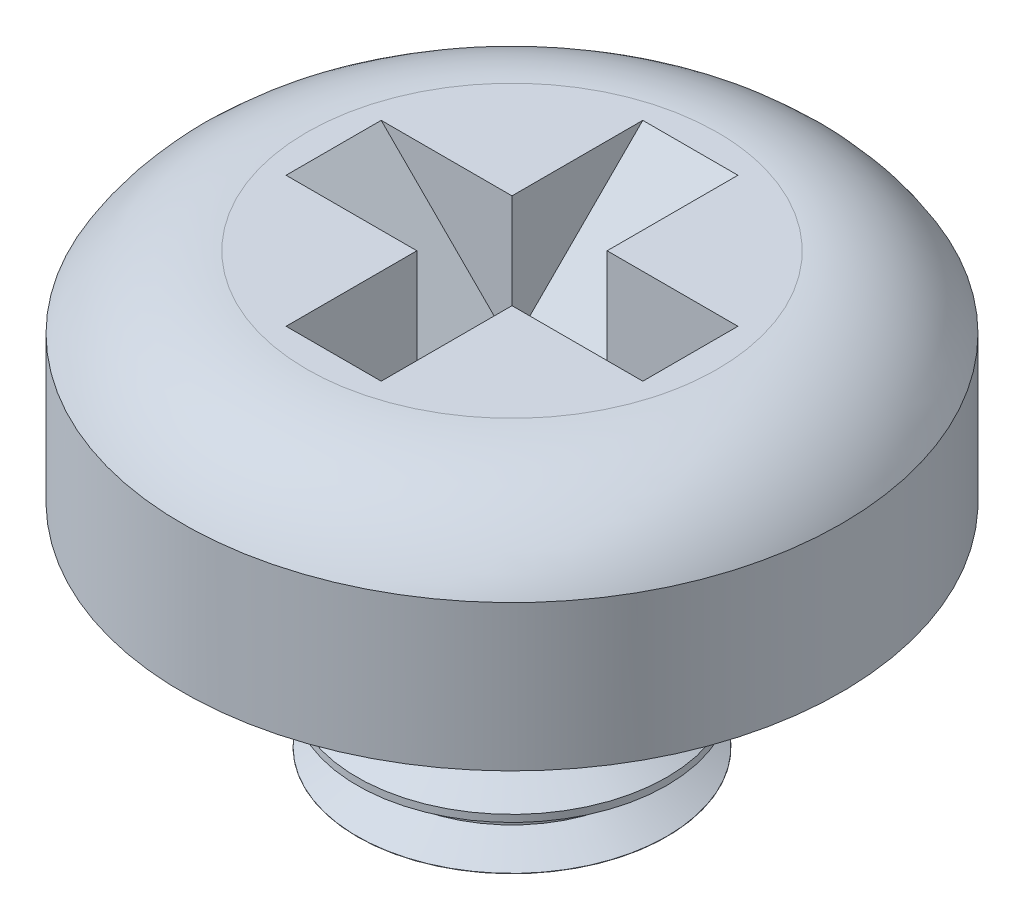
ISO-10303-21;
HEADER;
FILE_DESCRIPTION(('STEP AP214'),'2;1');
FILE_NAME('part.step','',(''),(''),'','','');
FILE_SCHEMA(('AUTOMOTIVE_DESIGN { 1 0 10303 214 1 1 1 1 }'));
ENDSEC;
DATA;
#1=APPLICATION_CONTEXT('core data for automotive mechanical design processes');
#2=APPLICATION_PROTOCOL_DEFINITION('international standard','automotive_design',2000,#1);
#3=PRODUCT_CONTEXT('',#1,'mechanical');
#4=PRODUCT('Part','Part','',(#3));
#5=PRODUCT_RELATED_PRODUCT_CATEGORY('part','',(#4));
#6=PRODUCT_DEFINITION_FORMATION('','',#4);
#7=PRODUCT_DEFINITION_CONTEXT('part definition',#1,'design');
#8=PRODUCT_DEFINITION('design','',#6,#7);
#9=PRODUCT_DEFINITION_SHAPE('','',#8);
#10=(LENGTH_UNIT() NAMED_UNIT(*) SI_UNIT(.MILLI.,.METRE.));
#11=(NAMED_UNIT(*) PLANE_ANGLE_UNIT() SI_UNIT($,.RADIAN.));
#12=(NAMED_UNIT(*) SI_UNIT($,.STERADIAN.) SOLID_ANGLE_UNIT());
#13=UNCERTAINTY_MEASURE_WITH_UNIT(LENGTH_MEASURE(1.E-05),#10,'distance_accuracy_value','');
#14=(GEOMETRIC_REPRESENTATION_CONTEXT(3) GLOBAL_UNCERTAINTY_ASSIGNED_CONTEXT((#13)) GLOBAL_UNIT_ASSIGNED_CONTEXT((#10,
#11,#12)) REPRESENTATION_CONTEXT('',''));
#15=CARTESIAN_POINT('',(0.,0.,0.));
#16=DIRECTION('',(0.,0.,1.));
#17=DIRECTION('',(1.,0.,0.));
#18=AXIS2_PLACEMENT_3D('',#15,#16,#17);
#19=CARTESIAN_POINT('',(0.695421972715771,142.281830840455,0.));
#20=DIRECTION('',(0.,-1.,0.));
#21=DIRECTION('',(0.,0.,-1.));
#22=AXIS2_PLACEMENT_3D('',#19,#20,#21);
#23=CYLINDRICAL_SURFACE('',#22,2.404411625);
#24=CARTESIAN_POINT('',(0.695421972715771,142.281830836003,0.));
#25=DIRECTION('',(0.,-1.,0.));
#26=DIRECTION('',(1.,0.,0.));
#27=AXIS2_PLACEMENT_3D('',#24,#25,#26);
#28=CIRCLE('',#27,2.40441162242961);
#29=CARTESIAN_POINT('',(3.09983359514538,142.281830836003,0.));
#30=VERTEX_POINT('',#29);
#31=EDGE_CURVE('E371',#30,#30,#28,.F.);
#32=ORIENTED_EDGE('',*,*,#31,.F.);
#33=EDGE_LOOP('',(#32));
#34=FACE_BOUND('',#33,.T.);
#35=CARTESIAN_POINT('',(0.695421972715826,142.276872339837,0.));
#36=DIRECTION('',(0.,-1.,0.));
#37=DIRECTION('',(0.,0.,-1.));
#38=AXIS2_PLACEMENT_3D('',#35,#36,#37);
#39=CIRCLE('',#38,2.404411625);
#40=CARTESIAN_POINT('',(0.695421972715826,142.276872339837,-2.40441162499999));
#41=VERTEX_POINT('',#40);
#42=EDGE_CURVE('E45',#41,#41,#39,.F.);
#43=ORIENTED_EDGE('',*,*,#42,.T.);
#44=EDGE_LOOP('',(#43));
#45=FACE_BOUND('',#44,.T.);
#46=ADVANCED_FACE('F40',(#34,#45),#23,.T.);
#47=CARTESIAN_POINT('',(0.695421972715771,142.574565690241,0.));
#48=DIRECTION('',(0.,-1.,0.));
#49=DIRECTION('',(0.,0.,-1.));
#50=AXIS2_PLACEMENT_3D('',#47,#48,#49);
#51=CONICAL_SURFACE('',#50,1.89738000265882,1.04719753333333);
#52=ORIENTED_EDGE('',*,*,#31,.T.);
#53=EDGE_LOOP('',(#52));
#54=FACE_BOUND('',#53,.T.);
#55=CARTESIAN_POINT('',(0.695421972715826,142.574565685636,0.));
#56=DIRECTION('',(0.,-1.,0.));
#57=DIRECTION('',(1.,0.,0.));
#58=AXIS2_PLACEMENT_3D('',#55,#56,#57);
#59=CIRCLE('',#58,1.89738);
#60=CARTESIAN_POINT('',(2.59280197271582,142.574565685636,0.));
#61=VERTEX_POINT('',#60);
#62=EDGE_CURVE('E368',#61,#61,#59,.F.);
#63=ORIENTED_EDGE('',*,*,#62,.F.);
#64=EDGE_LOOP('',(#63));
#65=FACE_BOUND('',#64,.T.);
#66=ADVANCED_FACE('F415',(#54,#65),#51,.T.);
#67=CARTESIAN_POINT('',(0.695421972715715,142.673710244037,0.));
#68=DIRECTION('',(0.,-1.,0.));
#69=DIRECTION('',(0.,0.,-1.));
#70=AXIS2_PLACEMENT_3D('',#67,#68,#69);
#71=CYLINDRICAL_SURFACE('',#70,1.89738);
#72=ORIENTED_EDGE('',*,*,#62,.T.);
#73=EDGE_LOOP('',(#72));
#74=FACE_BOUND('',#73,.T.);
#75=CARTESIAN_POINT('',(0.695421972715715,142.673710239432,0.));
#76=DIRECTION('',(0.,1.,0.));
#77=DIRECTION('',(1.,0.,0.));
#78=AXIS2_PLACEMENT_3D('',#75,#76,#77);
#79=CIRCLE('',#78,1.89738000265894);
#80=CARTESIAN_POINT('',(2.59280197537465,142.673710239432,0.));
#81=VERTEX_POINT('',#80);
#82=EDGE_CURVE('E365',#81,#81,#79,.T.);
#83=ORIENTED_EDGE('',*,*,#82,.F.);
#84=EDGE_LOOP('',(#83));
#85=FACE_BOUND('',#84,.T.);
#86=ADVANCED_FACE('F421',(#74,#85),#71,.T.);
#87=CARTESIAN_POINT('',(0.695421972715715,142.673710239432,0.));
#88=DIRECTION('',(0.,1.,0.));
#89=DIRECTION('',(0.,0.,1.));
#90=AXIS2_PLACEMENT_3D('',#87,#88,#89);
#91=CONICAL_SURFACE('',#90,1.89738000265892,1.04719753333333);
#92=ORIENTED_EDGE('',*,*,#82,.T.);
#93=EDGE_LOOP('',(#92));
#94=FACE_BOUND('',#93,.T.);
#95=CARTESIAN_POINT('',(0.695421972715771,142.966445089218,0.));
#96=DIRECTION('',(0.,-1.,0.));
#97=DIRECTION('',(1.,0.,0.));
#98=AXIS2_PLACEMENT_3D('',#95,#96,#97);
#99=CIRCLE('',#98,2.404411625);
#100=CARTESIAN_POINT('',(3.09983359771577,142.966445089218,0.));
#101=VERTEX_POINT('',#100);
#102=EDGE_CURVE('E362',#101,#101,#99,.F.);
#103=ORIENTED_EDGE('',*,*,#102,.F.);
#104=EDGE_LOOP('',(#103));
#105=FACE_BOUND('',#104,.T.);
#106=ADVANCED_FACE('F430',(#94,#105),#91,.T.);
#107=CARTESIAN_POINT('',(0.695421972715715,143.075580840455,0.));
#108=DIRECTION('',(0.,-1.,0.));
#109=DIRECTION('',(0.,0.,-1.));
#110=AXIS2_PLACEMENT_3D('',#107,#108,#109);
#111=CYLINDRICAL_SURFACE('',#110,2.404411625);
#112=ORIENTED_EDGE('',*,*,#102,.T.);
#113=EDGE_LOOP('',(#112));
#114=FACE_BOUND('',#113,.T.);
#115=CARTESIAN_POINT('',(0.695421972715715,143.075580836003,0.));
#116=DIRECTION('',(0.,-1.,0.));
#117=DIRECTION('',(1.,0.,0.));
#118=AXIS2_PLACEMENT_3D('',#115,#116,#117);
#119=CIRCLE('',#118,2.40441162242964);
#120=CARTESIAN_POINT('',(3.09983359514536,143.075580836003,0.));
#121=VERTEX_POINT('',#120);
#122=EDGE_CURVE('E359',#121,#121,#119,.F.);
#123=ORIENTED_EDGE('',*,*,#122,.F.);
#124=EDGE_LOOP('',(#123));
#125=FACE_BOUND('',#124,.T.);
#126=ADVANCED_FACE('F434',(#114,#125),#111,.T.);
#127=CARTESIAN_POINT('',(0.695421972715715,143.368315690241,0.));
#128=DIRECTION('',(0.,-1.,0.));
#129=DIRECTION('',(0.,0.,-1.));
#130=AXIS2_PLACEMENT_3D('',#127,#128,#129);
#131=CONICAL_SURFACE('',#130,1.89738000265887,1.04719753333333);
#132=ORIENTED_EDGE('',*,*,#122,.T.);
#133=EDGE_LOOP('',(#132));
#134=FACE_BOUND('',#133,.T.);
#135=CARTESIAN_POINT('',(0.695421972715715,143.368315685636,0.));
#136=DIRECTION('',(0.,-1.,0.));
#137=DIRECTION('',(1.,0.,0.));
#138=AXIS2_PLACEMENT_3D('',#135,#136,#137);
#139=CIRCLE('',#138,1.89738);
#140=CARTESIAN_POINT('',(2.59280197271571,143.368315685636,0.));
#141=VERTEX_POINT('',#140);
#142=EDGE_CURVE('E356',#141,#141,#139,.F.);
#143=ORIENTED_EDGE('',*,*,#142,.F.);
#144=EDGE_LOOP('',(#143));
#145=FACE_BOUND('',#144,.T.);
#146=ADVANCED_FACE('F438',(#134,#145),#131,.T.);
#147=CARTESIAN_POINT('',(0.695421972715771,143.467460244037,0.));
#148=DIRECTION('',(0.,-1.,0.));
#149=DIRECTION('',(0.,0.,-1.));
#150=AXIS2_PLACEMENT_3D('',#147,#148,#149);
#151=CYLINDRICAL_SURFACE('',#150,1.89738);
#152=ORIENTED_EDGE('',*,*,#142,.T.);
#153=EDGE_LOOP('',(#152));
#154=FACE_BOUND('',#153,.T.);
#155=CARTESIAN_POINT('',(0.695421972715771,143.467460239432,0.));
#156=DIRECTION('',(0.,1.,0.));
#157=DIRECTION('',(1.,0.,0.));
#158=AXIS2_PLACEMENT_3D('',#155,#156,#157);
#159=CIRCLE('',#158,1.89738000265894);
#160=CARTESIAN_POINT('',(2.59280197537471,143.467460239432,0.));
#161=VERTEX_POINT('',#160);
#162=EDGE_CURVE('E158',#161,#161,#159,.T.);
#163=ORIENTED_EDGE('',*,*,#162,.F.);
#164=EDGE_LOOP('',(#163));
#165=FACE_BOUND('',#164,.T.);
#166=ADVANCED_FACE('F442',(#154,#165),#151,.T.);
#167=CARTESIAN_POINT('',(0.695421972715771,143.467460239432,0.));
#168=DIRECTION('',(0.,1.,0.));
#169=DIRECTION('',(0.,0.,1.));
#170=AXIS2_PLACEMENT_3D('',#167,#168,#169);
#171=CONICAL_SURFACE('',#170,1.89738000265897,1.04719753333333);
#172=ORIENTED_EDGE('',*,*,#162,.T.);
#173=EDGE_LOOP('',(#172));
#174=FACE_BOUND('',#173,.T.);
#175=CARTESIAN_POINT('',(0.695421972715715,143.760195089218,0.));
#176=DIRECTION('',(0.,-1.,0.));
#177=DIRECTION('',(1.,0.,0.));
#178=AXIS2_PLACEMENT_3D('',#175,#176,#177);
#179=CIRCLE('',#178,2.404411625);
#180=CARTESIAN_POINT('',(3.09983359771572,143.760195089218,0.));
#181=VERTEX_POINT('',#180);
#182=EDGE_CURVE('E202',#181,#181,#179,.F.);
#183=ORIENTED_EDGE('',*,*,#182,.F.);
#184=EDGE_LOOP('',(#183));
#185=FACE_BOUND('',#184,.T.);
#186=ADVANCED_FACE('F446',(#174,#185),#171,.T.);
#187=CARTESIAN_POINT('',(0.695421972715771,146.186884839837,0.));
#188=DIRECTION('',(0.707106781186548,0.707106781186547,0.));
#189=DIRECTION('',(-0.707106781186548,0.707106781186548,0.));
#190=AXIS2_PLACEMENT_3D('',#187,#188,#189);
#191=PLANE('',#190);
#192=DIRECTION('',(0.,0.,1.));
#193=VECTOR('',#192,1.);
#194=CARTESIAN_POINT('',(0.695421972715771,146.186884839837,0.));
#195=LINE('',#194,#193);
#196=CARTESIAN_POINT('',(0.695421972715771,146.186884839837,-0.738716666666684));
#197=VERTEX_POINT('',#196);
#198=CARTESIAN_POINT('',(0.695421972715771,146.186884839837,0.));
#199=VERTEX_POINT('',#198);
#200=EDGE_CURVE('E151',#197,#199,#195,.T.);
#201=ORIENTED_EDGE('',*,*,#200,.F.);
#202=DIRECTION('',(0.707106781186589,-0.707106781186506,0.));
#203=VECTOR('',#202,1.);
#204=CARTESIAN_POINT('',(-0.0432946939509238,146.925601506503,-0.738716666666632));
#205=LINE('',#204,#203);
#206=CARTESIAN_POINT('',(-0.0432946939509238,146.925601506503,-0.738716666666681));
#207=VERTEX_POINT('',#206);
#208=EDGE_CURVE('E120',#207,#197,#205,.T.);
#209=ORIENTED_EDGE('',*,*,#208,.F.);
#210=DIRECTION('',(-0.577350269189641,0.577350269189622,-0.577350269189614));
#211=VECTOR('',#210,1.);
#212=CARTESIAN_POINT('',(0.695421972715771,146.186884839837,0.));
#213=LINE('',#212,#211);
#214=EDGE_CURVE('E186',#199,#207,#213,.T.);
#215=ORIENTED_EDGE('',*,*,#214,.F.);
#216=EDGE_LOOP('',(#201,#209,#215));
#217=FACE_BOUND('',#216,.T.);
#218=ADVANCED_FACE('F187',(#217),#191,.T.);
#219=CARTESIAN_POINT('',(3.46560947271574,148.957072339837,0.));
#220=DIRECTION('',(-0.707106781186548,0.707106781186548,0.));
#221=DIRECTION('',(-0.707106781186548,-0.707106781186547,0.));
#222=AXIS2_PLACEMENT_3D('',#219,#220,#221);
#223=PLANE('',#222);
#224=DIRECTION('',(0.707106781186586,0.707106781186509,0.));
#225=VECTOR('',#224,1.);
#226=CARTESIAN_POINT('',(0.695421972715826,146.186884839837,-0.738716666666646));
#227=LINE('',#226,#225);
#228=CARTESIAN_POINT('',(1.43413863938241,146.925601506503,-0.738716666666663));
#229=VERTEX_POINT('',#228);
#230=EDGE_CURVE('E157',#197,#229,#227,.T.);
#231=ORIENTED_EDGE('',*,*,#230,.F.);
#232=ORIENTED_EDGE('',*,*,#200,.T.);
#233=DIRECTION('',(-0.577350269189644,-0.577350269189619,0.577350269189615));
#234=VECTOR('',#233,1.);
#235=CARTESIAN_POINT('',(1.43413863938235,146.925601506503,-0.738716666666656));
#236=LINE('',#235,#234);
#237=EDGE_CURVE('E154',#229,#199,#236,.T.);
#238=ORIENTED_EDGE('',*,*,#237,.F.);
#239=EDGE_LOOP('',(#231,#232,#238));
#240=FACE_BOUND('',#239,.T.);
#241=ADVANCED_FACE('F153',(#240),#223,.T.);
#242=CARTESIAN_POINT('',(0.695421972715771,148.957072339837,-2.77018750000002));
#243=DIRECTION('',(0.,0.707106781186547,0.707106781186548));
#244=DIRECTION('',(0.,-0.707106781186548,0.707106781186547));
#245=AXIS2_PLACEMENT_3D('',#242,#243,#244);
#246=PLANE('',#245);
#247=DIRECTION('',(1.,0.,0.));
#248=VECTOR('',#247,1.);
#249=CARTESIAN_POINT('',(0.695421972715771,146.186884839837,0.));
#250=LINE('',#249,#248);
#251=CARTESIAN_POINT('',(1.43413863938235,146.186884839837,0.));
#252=VERTEX_POINT('',#251);
#253=EDGE_CURVE('E163',#252,#199,#250,.F.);
#254=ORIENTED_EDGE('',*,*,#253,.F.);
#255=DIRECTION('',(0.,-0.707106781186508,0.707106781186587));
#256=VECTOR('',#255,1.);
#257=CARTESIAN_POINT('',(1.43413863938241,146.925601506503,-0.738716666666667));
#258=LINE('',#257,#256);
#259=EDGE_CURVE('E166',#229,#252,#258,.T.);
#260=ORIENTED_EDGE('',*,*,#259,.F.);
#261=ORIENTED_EDGE('',*,*,#237,.T.);
#262=EDGE_LOOP('',(#254,#260,#261));
#263=FACE_BOUND('',#262,.T.);
#264=ADVANCED_FACE('F162',(#263),#246,.T.);
#265=CARTESIAN_POINT('',(0.695421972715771,146.186884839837,0.));
#266=DIRECTION('',(0.,0.707106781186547,-0.707106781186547));
#267=DIRECTION('',(0.,0.707106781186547,0.707106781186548));
#268=AXIS2_PLACEMENT_3D('',#265,#266,#267);
#269=PLANE('',#268);
#270=DIRECTION('',(0.,0.707106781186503,0.707106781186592));
#271=VECTOR('',#270,1.);
#272=CARTESIAN_POINT('',(1.43413863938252,146.186884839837,0.));
#273=LINE('',#272,#271);
#274=CARTESIAN_POINT('',(1.43413863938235,146.925601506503,0.738716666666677));
#275=VERTEX_POINT('',#274);
#276=EDGE_CURVE('E174',#252,#275,#273,.T.);
#277=ORIENTED_EDGE('',*,*,#276,.F.);
#278=ORIENTED_EDGE('',*,*,#253,.T.);
#279=DIRECTION('',(-0.577350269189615,-0.577350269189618,-0.577350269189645));
#280=VECTOR('',#279,1.);
#281=CARTESIAN_POINT('',(1.43413863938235,146.925601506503,0.738716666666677));
#282=LINE('',#281,#280);
#283=EDGE_CURVE('E171',#275,#199,#282,.T.);
#284=ORIENTED_EDGE('',*,*,#283,.F.);
#285=EDGE_LOOP('',(#277,#278,#284));
#286=FACE_BOUND('',#285,.T.);
#287=ADVANCED_FACE('F170',(#286),#269,.T.);
#288=CARTESIAN_POINT('',(3.46560947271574,148.957072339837,0.));
#289=DIRECTION('',(-0.707106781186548,0.707106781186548,0.));
#290=DIRECTION('',(-0.707106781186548,-0.707106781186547,0.));
#291=AXIS2_PLACEMENT_3D('',#288,#289,#290);
#292=PLANE('',#291);
#293=DIRECTION('',(0.,0.,1.));
#294=VECTOR('',#293,1.);
#295=CARTESIAN_POINT('',(0.695421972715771,146.186884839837,0.));
#296=LINE('',#295,#294);
#297=CARTESIAN_POINT('',(0.695421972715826,146.186884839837,0.73871666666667));
#298=VERTEX_POINT('',#297);
#299=EDGE_CURVE('E178',#298,#199,#296,.F.);
#300=ORIENTED_EDGE('',*,*,#299,.F.);
#301=DIRECTION('',(-0.707106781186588,-0.707106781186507,0.));
#302=VECTOR('',#301,1.);
#303=CARTESIAN_POINT('',(1.43413863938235,146.925601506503,0.738716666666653));
#304=LINE('',#303,#302);
#305=EDGE_CURVE('E180',#275,#298,#304,.T.);
#306=ORIENTED_EDGE('',*,*,#305,.F.);
#307=ORIENTED_EDGE('',*,*,#283,.T.);
#308=EDGE_LOOP('',(#300,#306,#307));
#309=FACE_BOUND('',#308,.T.);
#310=ADVANCED_FACE('F177',(#309),#292,.T.);
#311=CARTESIAN_POINT('',(0.695421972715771,146.186884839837,0.));
#312=DIRECTION('',(0.707106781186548,0.707106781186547,0.));
#313=DIRECTION('',(-0.707106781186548,0.707106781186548,0.));
#314=AXIS2_PLACEMENT_3D('',#311,#312,#313);
#315=PLANE('',#314);
#316=DIRECTION('',(-0.707106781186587,0.707106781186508,0.));
#317=VECTOR('',#316,1.);
#318=CARTESIAN_POINT('',(0.695421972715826,146.186884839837,0.738716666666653));
#319=LINE('',#318,#317);
#320=CARTESIAN_POINT('',(-0.0432946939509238,146.925601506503,0.738716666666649));
#321=VERTEX_POINT('',#320);
#322=EDGE_CURVE('E184',#298,#321,#319,.T.);
#323=ORIENTED_EDGE('',*,*,#322,.F.);
#324=ORIENTED_EDGE('',*,*,#299,.T.);
#325=DIRECTION('',(0.577350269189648,-0.577350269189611,-0.577350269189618));
#326=VECTOR('',#325,1.);
#327=CARTESIAN_POINT('',(-0.0432946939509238,146.925601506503,0.738716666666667));
#328=LINE('',#327,#326);
#329=EDGE_CURVE('E128',#321,#199,#328,.T.);
#330=ORIENTED_EDGE('',*,*,#329,.F.);
#331=EDGE_LOOP('',(#323,#324,#330));
#332=FACE_BOUND('',#331,.T.);
#333=ADVANCED_FACE('F182',(#332),#315,.T.);
#334=CARTESIAN_POINT('',(0.695421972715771,146.186884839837,0.));
#335=DIRECTION('',(0.,0.707106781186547,-0.707106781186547));
#336=DIRECTION('',(0.,0.707106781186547,0.707106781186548));
#337=AXIS2_PLACEMENT_3D('',#334,#335,#336);
#338=PLANE('',#337);
#339=DIRECTION('',(1.,0.,0.));
#340=VECTOR('',#339,1.);
#341=CARTESIAN_POINT('',(0.695421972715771,146.186884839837,0.));
#342=LINE('',#341,#340);
#343=CARTESIAN_POINT('',(-0.0432946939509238,146.186884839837,0.));
#344=VERTEX_POINT('',#343);
#345=EDGE_CURVE('E192',#344,#199,#342,.T.);
#346=ORIENTED_EDGE('',*,*,#345,.F.);
#347=DIRECTION('',(0.,-0.707106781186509,-0.707106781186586));
#348=VECTOR('',#347,1.);
#349=CARTESIAN_POINT('',(-0.0432946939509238,146.925601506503,0.738716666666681));
#350=LINE('',#349,#348);
#351=EDGE_CURVE('E197',#321,#344,#350,.T.);
#352=ORIENTED_EDGE('',*,*,#351,.F.);
#353=ORIENTED_EDGE('',*,*,#329,.T.);
#354=EDGE_LOOP('',(#346,#352,#353));
#355=FACE_BOUND('',#354,.T.);
#356=ADVANCED_FACE('F195',(#355),#338,.T.);
#357=CARTESIAN_POINT('',(0.695421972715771,148.957072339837,-2.77018750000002));
#358=DIRECTION('',(0.,0.707106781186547,0.707106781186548));
#359=DIRECTION('',(0.,-0.707106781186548,0.707106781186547));
#360=AXIS2_PLACEMENT_3D('',#357,#358,#359);
#361=PLANE('',#360);
#362=DIRECTION('',(0.,0.707106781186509,-0.707106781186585));
#363=VECTOR('',#362,1.);
#364=CARTESIAN_POINT('',(-0.0432946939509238,146.186884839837,0.));
#365=LINE('',#364,#363);
#366=EDGE_CURVE('E201',#344,#207,#365,.T.);
#367=ORIENTED_EDGE('',*,*,#366,.F.);
#368=ORIENTED_EDGE('',*,*,#345,.T.);
#369=ORIENTED_EDGE('',*,*,#214,.T.);
#370=EDGE_LOOP('',(#367,#368,#369));
#371=FACE_BOUND('',#370,.T.);
#372=ADVANCED_FACE('F199',(#371),#361,.T.);
#373=CARTESIAN_POINT('',(0.695421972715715,143.869330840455,0.));
#374=DIRECTION('',(0.,-1.,0.));
#375=DIRECTION('',(0.,0.,-1.));
#376=AXIS2_PLACEMENT_3D('',#373,#374,#375);
#377=CYLINDRICAL_SURFACE('',#376,2.404411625);
#378=ORIENTED_EDGE('',*,*,#182,.T.);
#379=EDGE_LOOP('',(#378));
#380=FACE_BOUND('',#379,.T.);
#381=CARTESIAN_POINT('',(0.695421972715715,143.869330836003,0.));
#382=DIRECTION('',(0.,-1.,0.));
#383=DIRECTION('',(1.,0.,0.));
#384=AXIS2_PLACEMENT_3D('',#381,#382,#383);
#385=CIRCLE('',#384,2.40441162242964);
#386=CARTESIAN_POINT('',(3.09983359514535,143.869330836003,0.));
#387=VERTEX_POINT('',#386);
#388=EDGE_CURVE('E214',#387,#387,#385,.F.);
#389=ORIENTED_EDGE('',*,*,#388,.F.);
#390=EDGE_LOOP('',(#389));
#391=FACE_BOUND('',#390,.T.);
#392=ADVANCED_FACE('F467',(#380,#391),#377,.T.);
#393=CARTESIAN_POINT('',(0.695421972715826,146.186884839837,-0.738716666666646));
#394=DIRECTION('',(0.,0.,1.));
#395=DIRECTION('',(1.,0.,0.));
#396=AXIS2_PLACEMENT_3D('',#393,#394,#395);
#397=PLANE('',#396);
#398=ORIENTED_EDGE('',*,*,#208,.T.);
#399=ORIENTED_EDGE('',*,*,#230,.T.);
#400=DIRECTION('',(1.,0.,0.));
#401=VECTOR('',#400,1.);
#402=CARTESIAN_POINT('',(0.695421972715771,146.925601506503,-0.738716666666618));
#403=LINE('',#402,#401);
#404=EDGE_CURVE('E219',#207,#229,#403,.T.);
#405=ORIENTED_EDGE('',*,*,#404,.F.);
#406=EDGE_LOOP('',(#398,#399,#405));
#407=FACE_BOUND('',#406,.T.);
#408=ADVANCED_FACE('F470',(#407),#397,.T.);
#409=CARTESIAN_POINT('',(1.43413863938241,148.957072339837,2.77018750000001));
#410=DIRECTION('',(-1.,0.,0.));
#411=DIRECTION('',(0.,0.,1.));
#412=AXIS2_PLACEMENT_3D('',#409,#410,#411);
#413=PLANE('',#412);
#414=ORIENTED_EDGE('',*,*,#259,.T.);
#415=ORIENTED_EDGE('',*,*,#276,.T.);
#416=DIRECTION('',(0.,0.,1.));
#417=VECTOR('',#416,1.);
#418=CARTESIAN_POINT('',(1.43413863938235,146.925601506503,0.));
#419=LINE('',#418,#417);
#420=EDGE_CURVE('E218',#229,#275,#419,.T.);
#421=ORIENTED_EDGE('',*,*,#420,.F.);
#422=EDGE_LOOP('',(#414,#415,#421));
#423=FACE_BOUND('',#422,.T.);
#424=ADVANCED_FACE('F474',(#423),#413,.T.);
#425=CARTESIAN_POINT('',(-2.07476552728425,148.957072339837,0.738716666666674));
#426=DIRECTION('',(0.,0.,-1.));
#427=DIRECTION('',(-1.,0.,0.));
#428=AXIS2_PLACEMENT_3D('',#425,#426,#427);
#429=PLANE('',#428);
#430=ORIENTED_EDGE('',*,*,#305,.T.);
#431=ORIENTED_EDGE('',*,*,#322,.T.);
#432=DIRECTION('',(1.,0.,0.));
#433=VECTOR('',#432,1.);
#434=CARTESIAN_POINT('',(0.695421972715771,146.925601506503,0.738716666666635));
#435=LINE('',#434,#433);
#436=EDGE_CURVE('E224',#275,#321,#435,.F.);
#437=ORIENTED_EDGE('',*,*,#436,.F.);
#438=EDGE_LOOP('',(#430,#431,#437));
#439=FACE_BOUND('',#438,.T.);
#440=ADVANCED_FACE('F478',(#439),#429,.T.);
#441=CARTESIAN_POINT('',(-0.0432946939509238,146.186884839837,0.));
#442=DIRECTION('',(1.,0.,0.));
#443=DIRECTION('',(0.,0.,-1.));
#444=AXIS2_PLACEMENT_3D('',#441,#442,#443);
#445=PLANE('',#444);
#446=ORIENTED_EDGE('',*,*,#351,.T.);
#447=ORIENTED_EDGE('',*,*,#366,.T.);
#448=DIRECTION('',(0.,0.,1.));
#449=VECTOR('',#448,1.);
#450=CARTESIAN_POINT('',(-0.0432946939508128,146.925601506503,0.));
#451=LINE('',#450,#449);
#452=EDGE_CURVE('E229',#321,#207,#451,.F.);
#453=ORIENTED_EDGE('',*,*,#452,.F.);
#454=EDGE_LOOP('',(#446,#447,#453));
#455=FACE_BOUND('',#454,.T.);
#456=ADVANCED_FACE('F482',(#455),#445,.T.);
#457=CARTESIAN_POINT('',(0.695421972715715,144.162065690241,0.));
#458=DIRECTION('',(0.,-1.,0.));
#459=DIRECTION('',(0.,0.,-1.));
#460=AXIS2_PLACEMENT_3D('',#457,#458,#459);
#461=CONICAL_SURFACE('',#460,1.89738000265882,1.04719753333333);
#462=ORIENTED_EDGE('',*,*,#388,.T.);
#463=EDGE_LOOP('',(#462));
#464=FACE_BOUND('',#463,.T.);
#465=CARTESIAN_POINT('',(0.695421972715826,144.162065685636,0.));
#466=DIRECTION('',(0.,-1.,0.));
#467=DIRECTION('',(1.,0.,0.));
#468=AXIS2_PLACEMENT_3D('',#465,#466,#467);
#469=CIRCLE('',#468,1.89738);
#470=CARTESIAN_POINT('',(2.59280197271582,144.162065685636,0.));
#471=VERTEX_POINT('',#470);
#472=EDGE_CURVE('E233',#471,#471,#469,.F.);
#473=ORIENTED_EDGE('',*,*,#472,.F.);
#474=EDGE_LOOP('',(#473));
#475=FACE_BOUND('',#474,.T.);
#476=ADVANCED_FACE('F486',(#464,#475),#461,.T.);
#477=CARTESIAN_POINT('',(0.695421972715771,148.957072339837,-2.77018750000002));
#478=DIRECTION('',(0.,0.707106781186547,0.707106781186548));
#479=DIRECTION('',(0.,-0.707106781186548,0.707106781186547));
#480=AXIS2_PLACEMENT_3D('',#477,#478,#479);
#481=PLANE('',#480);
#482=DIRECTION('',(1.,0.,0.));
#483=VECTOR('',#482,1.);
#484=CARTESIAN_POINT('',(0.695421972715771,148.957072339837,-2.77018750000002));
#485=LINE('',#484,#483);
#486=CARTESIAN_POINT('',(1.43413863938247,148.957072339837,-2.77018749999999));
#487=VERTEX_POINT('',#486);
#488=CARTESIAN_POINT('',(-0.0432946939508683,148.957072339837,-2.77018749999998));
#489=VERTEX_POINT('',#488);
#490=EDGE_CURVE('E216',#487,#489,#485,.F.);
#491=ORIENTED_EDGE('',*,*,#490,.T.);
#492=DIRECTION('',(0.,0.707106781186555,-0.70710678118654));
#493=VECTOR('',#492,1.);
#494=CARTESIAN_POINT('',(-0.0432946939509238,146.925601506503,-0.738716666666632));
#495=LINE('',#494,#493);
#496=EDGE_CURVE('E236',#207,#489,#495,.T.);
#497=ORIENTED_EDGE('',*,*,#496,.F.);
#498=ORIENTED_EDGE('',*,*,#404,.T.);
#499=DIRECTION('',(0.,-0.707106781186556,0.707106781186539));
#500=VECTOR('',#499,1.);
#501=CARTESIAN_POINT('',(1.43413863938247,148.957072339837,-2.77018749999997));
#502=LINE('',#501,#500);
#503=EDGE_CURVE('E238',#487,#229,#502,.T.);
#504=ORIENTED_EDGE('',*,*,#503,.F.);
#505=EDGE_LOOP('',(#491,#497,#498,#504));
#506=FACE_BOUND('',#505,.T.);
#507=ADVANCED_FACE('F490',(#506),#481,.T.);
#508=CARTESIAN_POINT('',(3.46560947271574,148.957072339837,0.));
#509=DIRECTION('',(-0.707106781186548,0.707106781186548,0.));
#510=DIRECTION('',(-0.707106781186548,-0.707106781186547,0.));
#511=AXIS2_PLACEMENT_3D('',#508,#509,#510);
#512=PLANE('',#511);
#513=DIRECTION('',(0.,0.,1.));
#514=VECTOR('',#513,1.);
#515=CARTESIAN_POINT('',(3.46560947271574,148.957072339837,0.));
#516=LINE('',#515,#514);
#517=CARTESIAN_POINT('',(3.46560947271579,148.957072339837,0.738716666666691));
#518=VERTEX_POINT('',#517);
#519=CARTESIAN_POINT('',(3.46560947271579,148.957072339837,-0.738716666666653));
#520=VERTEX_POINT('',#519);
#521=EDGE_CURVE('E222',#518,#520,#516,.F.);
#522=ORIENTED_EDGE('',*,*,#521,.T.);
#523=DIRECTION('',(0.70710678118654,0.707106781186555,0.));
#524=VECTOR('',#523,1.);
#525=CARTESIAN_POINT('',(1.43413863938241,146.925601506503,-0.738716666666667));
#526=LINE('',#525,#524);
#527=EDGE_CURVE('E242',#229,#520,#526,.T.);
#528=ORIENTED_EDGE('',*,*,#527,.F.);
#529=ORIENTED_EDGE('',*,*,#420,.T.);
#530=DIRECTION('',(-0.707106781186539,-0.707106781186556,0.));
#531=VECTOR('',#530,1.);
#532=CARTESIAN_POINT('',(3.46560947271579,148.957072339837,0.738716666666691));
#533=LINE('',#532,#531);
#534=EDGE_CURVE('E245',#518,#275,#533,.T.);
#535=ORIENTED_EDGE('',*,*,#534,.F.);
#536=EDGE_LOOP('',(#522,#528,#529,#535));
#537=FACE_BOUND('',#536,.T.);
#538=ADVANCED_FACE('F494',(#537),#512,.T.);
#539=CARTESIAN_POINT('',(0.695421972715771,146.186884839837,0.));
#540=DIRECTION('',(0.,0.707106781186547,-0.707106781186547));
#541=DIRECTION('',(0.,0.707106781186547,0.707106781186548));
#542=AXIS2_PLACEMENT_3D('',#539,#540,#541);
#543=PLANE('',#542);
#544=DIRECTION('',(1.,0.,0.));
#545=VECTOR('',#544,1.);
#546=CARTESIAN_POINT('',(0.695421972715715,148.957072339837,2.77018750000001));
#547=LINE('',#546,#545);
#548=CARTESIAN_POINT('',(-0.0432946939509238,148.957072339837,2.7701875));
#549=VERTEX_POINT('',#548);
#550=CARTESIAN_POINT('',(1.43413863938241,148.957072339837,2.77018750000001));
#551=VERTEX_POINT('',#550);
#552=EDGE_CURVE('E227',#549,#551,#547,.T.);
#553=ORIENTED_EDGE('',*,*,#552,.T.);
#554=DIRECTION('',(0.,0.707106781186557,0.707106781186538));
#555=VECTOR('',#554,1.);
#556=CARTESIAN_POINT('',(1.43413863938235,146.925601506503,0.738716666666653));
#557=LINE('',#556,#555);
#558=EDGE_CURVE('E251',#275,#551,#557,.T.);
#559=ORIENTED_EDGE('',*,*,#558,.F.);
#560=ORIENTED_EDGE('',*,*,#436,.T.);
#561=DIRECTION('',(0.,-0.707106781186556,-0.707106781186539));
#562=VECTOR('',#561,1.);
#563=CARTESIAN_POINT('',(-0.0432946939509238,148.957072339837,2.7701875));
#564=LINE('',#563,#562);
#565=EDGE_CURVE('E254',#549,#321,#564,.T.);
#566=ORIENTED_EDGE('',*,*,#565,.F.);
#567=EDGE_LOOP('',(#553,#559,#560,#566));
#568=FACE_BOUND('',#567,.T.);
#569=ADVANCED_FACE('F498',(#568),#543,.T.);
#570=CARTESIAN_POINT('',(0.695421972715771,146.186884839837,0.));
#571=DIRECTION('',(0.707106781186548,0.707106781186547,0.));
#572=DIRECTION('',(-0.707106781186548,0.707106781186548,0.));
#573=AXIS2_PLACEMENT_3D('',#570,#571,#572);
#574=PLANE('',#573);
#575=DIRECTION('',(0.,0.,1.));
#576=VECTOR('',#575,1.);
#577=CARTESIAN_POINT('',(-2.07476552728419,148.957072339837,0.));
#578=LINE('',#577,#576);
#579=CARTESIAN_POINT('',(-2.07476552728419,148.957072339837,-0.738716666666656));
#580=VERTEX_POINT('',#579);
#581=CARTESIAN_POINT('',(-2.07476552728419,148.957072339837,0.738716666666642));
#582=VERTEX_POINT('',#581);
#583=EDGE_CURVE('E75',#580,#582,#578,.T.);
#584=ORIENTED_EDGE('',*,*,#583,.T.);
#585=DIRECTION('',(-0.70710678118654,0.707106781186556,0.));
#586=VECTOR('',#585,1.);
#587=CARTESIAN_POINT('',(-0.0432946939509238,146.925601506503,0.738716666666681));
#588=LINE('',#587,#586);
#589=EDGE_CURVE('E260',#321,#582,#588,.T.);
#590=ORIENTED_EDGE('',*,*,#589,.F.);
#591=ORIENTED_EDGE('',*,*,#452,.T.);
#592=DIRECTION('',(0.707106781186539,-0.707106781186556,0.));
#593=VECTOR('',#592,1.);
#594=CARTESIAN_POINT('',(-2.07476552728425,148.957072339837,-0.738716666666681));
#595=LINE('',#594,#593);
#596=EDGE_CURVE('E266',#580,#207,#595,.T.);
#597=ORIENTED_EDGE('',*,*,#596,.F.);
#598=EDGE_LOOP('',(#584,#590,#591,#597));
#599=FACE_BOUND('',#598,.T.);
#600=ADVANCED_FACE('F502',(#599),#574,.T.);
#601=CARTESIAN_POINT('',(0.695421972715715,144.261210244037,0.));
#602=DIRECTION('',(0.,-1.,0.));
#603=DIRECTION('',(0.,0.,-1.));
#604=AXIS2_PLACEMENT_3D('',#601,#602,#603);
#605=CYLINDRICAL_SURFACE('',#604,1.89738);
#606=ORIENTED_EDGE('',*,*,#472,.T.);
#607=EDGE_LOOP('',(#606));
#608=FACE_BOUND('',#607,.T.);
#609=CARTESIAN_POINT('',(0.695421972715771,144.261210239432,0.));
#610=DIRECTION('',(0.,1.,0.));
#611=DIRECTION('',(1.,0.,0.));
#612=AXIS2_PLACEMENT_3D('',#609,#610,#611);
#613=CIRCLE('',#612,1.89738000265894);
#614=CARTESIAN_POINT('',(2.59280197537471,144.261210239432,0.));
#615=VERTEX_POINT('',#614);
#616=EDGE_CURVE('E269',#615,#615,#613,.T.);
#617=ORIENTED_EDGE('',*,*,#616,.F.);
#618=EDGE_LOOP('',(#617));
#619=FACE_BOUND('',#618,.T.);
#620=ADVANCED_FACE('F506',(#608,#619),#605,.T.);
#621=CARTESIAN_POINT('',(-0.0432946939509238,146.186884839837,0.));
#622=DIRECTION('',(1.,0.,0.));
#623=DIRECTION('',(0.,0.,-1.));
#624=AXIS2_PLACEMENT_3D('',#621,#622,#623);
#625=PLANE('',#624);
#626=ORIENTED_EDGE('',*,*,#496,.T.);
#627=DIRECTION('',(0.,0.,1.));
#628=VECTOR('',#627,1.);
#629=CARTESIAN_POINT('',(-0.0432946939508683,148.957072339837,0.));
#630=LINE('',#629,#628);
#631=CARTESIAN_POINT('',(-0.0432946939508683,148.957072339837,-0.738716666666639));
#632=VERTEX_POINT('',#631);
#633=EDGE_CURVE('E111',#632,#489,#630,.F.);
#634=ORIENTED_EDGE('',*,*,#633,.F.);
#635=DIRECTION('',(0.,1.,0.));
#636=VECTOR('',#635,1.);
#637=CARTESIAN_POINT('',(-0.0432946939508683,146.186884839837,-0.738716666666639));
#638=LINE('',#637,#636);
#639=EDGE_CURVE('E263',#207,#632,#638,.T.);
#640=ORIENTED_EDGE('',*,*,#639,.F.);
#641=EDGE_LOOP('',(#626,#634,#640));
#642=FACE_BOUND('',#641,.T.);
#643=ADVANCED_FACE('F510',(#642),#625,.T.);
#644=CARTESIAN_POINT('',(1.43413863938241,148.957072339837,2.77018750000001));
#645=DIRECTION('',(-1.,0.,0.));
#646=DIRECTION('',(0.,0.,1.));
#647=AXIS2_PLACEMENT_3D('',#644,#645,#646);
#648=PLANE('',#647);
#649=DIRECTION('',(0.,0.,1.));
#650=VECTOR('',#649,1.);
#651=CARTESIAN_POINT('',(1.43413863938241,148.957072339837,0.));
#652=LINE('',#651,#650);
#653=CARTESIAN_POINT('',(1.43413863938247,148.957072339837,-0.738716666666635));
#654=VERTEX_POINT('',#653);
#655=EDGE_CURVE('E288',#487,#654,#652,.T.);
#656=ORIENTED_EDGE('',*,*,#655,.F.);
#657=ORIENTED_EDGE('',*,*,#503,.T.);
#658=DIRECTION('',(0.,1.,0.));
#659=VECTOR('',#658,1.);
#660=CARTESIAN_POINT('',(1.43413863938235,146.186884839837,-0.738716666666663));
#661=LINE('',#660,#659);
#662=EDGE_CURVE('E241',#654,#229,#661,.F.);
#663=ORIENTED_EDGE('',*,*,#662,.F.);
#664=EDGE_LOOP('',(#656,#657,#663));
#665=FACE_BOUND('',#664,.T.);
#666=ADVANCED_FACE('F514',(#665),#648,.T.);
#667=CARTESIAN_POINT('',(0.695421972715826,146.186884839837,-0.738716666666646));
#668=DIRECTION('',(0.,0.,1.));
#669=DIRECTION('',(1.,0.,0.));
#670=AXIS2_PLACEMENT_3D('',#667,#668,#669);
#671=PLANE('',#670);
#672=ORIENTED_EDGE('',*,*,#527,.T.);
#673=DIRECTION('',(1.,0.,0.));
#674=VECTOR('',#673,1.);
#675=CARTESIAN_POINT('',(4.36159618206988,148.957072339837,-0.73871666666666));
#676=LINE('',#675,#674);
#677=EDGE_CURVE('E285',#654,#520,#676,.T.);
#678=ORIENTED_EDGE('',*,*,#677,.F.);
#679=ORIENTED_EDGE('',*,*,#662,.T.);
#680=EDGE_LOOP('',(#672,#678,#679));
#681=FACE_BOUND('',#680,.T.);
#682=ADVANCED_FACE('F517',(#681),#671,.T.);
#683=CARTESIAN_POINT('',(-2.07476552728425,148.957072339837,0.738716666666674));
#684=DIRECTION('',(0.,0.,-1.));
#685=DIRECTION('',(-1.,0.,0.));
#686=AXIS2_PLACEMENT_3D('',#683,#684,#685);
#687=PLANE('',#686);
#688=DIRECTION('',(1.,0.,0.));
#689=VECTOR('',#688,1.);
#690=CARTESIAN_POINT('',(4.36159618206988,148.957072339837,0.738716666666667));
#691=LINE('',#690,#689);
#692=CARTESIAN_POINT('',(1.43413863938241,148.957072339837,0.738716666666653));
#693=VERTEX_POINT('',#692);
#694=EDGE_CURVE('E282',#518,#693,#691,.F.);
#695=ORIENTED_EDGE('',*,*,#694,.F.);
#696=ORIENTED_EDGE('',*,*,#534,.T.);
#697=DIRECTION('',(0.,1.,0.));
#698=VECTOR('',#697,1.);
#699=CARTESIAN_POINT('',(1.43413863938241,148.957072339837,0.738716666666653));
#700=LINE('',#699,#698);
#701=EDGE_CURVE('E250',#693,#275,#700,.F.);
#702=ORIENTED_EDGE('',*,*,#701,.F.);
#703=EDGE_LOOP('',(#695,#696,#702));
#704=FACE_BOUND('',#703,.T.);
#705=ADVANCED_FACE('F521',(#704),#687,.T.);
#706=CARTESIAN_POINT('',(1.43413863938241,148.957072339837,2.77018750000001));
#707=DIRECTION('',(-1.,0.,0.));
#708=DIRECTION('',(0.,0.,1.));
#709=AXIS2_PLACEMENT_3D('',#706,#707,#708);
#710=PLANE('',#709);
#711=ORIENTED_EDGE('',*,*,#558,.T.);
#712=DIRECTION('',(0.,0.,1.));
#713=VECTOR('',#712,1.);
#714=CARTESIAN_POINT('',(1.43413863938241,148.957072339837,0.));
#715=LINE('',#714,#713);
#716=EDGE_CURVE('E279',#693,#551,#715,.T.);
#717=ORIENTED_EDGE('',*,*,#716,.F.);
#718=ORIENTED_EDGE('',*,*,#701,.T.);
#719=EDGE_LOOP('',(#711,#717,#718));
#720=FACE_BOUND('',#719,.T.);
#721=ADVANCED_FACE('F525',(#720),#710,.T.);
#722=CARTESIAN_POINT('',(-0.0432946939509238,146.186884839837,0.));
#723=DIRECTION('',(1.,0.,0.));
#724=DIRECTION('',(0.,0.,-1.));
#725=AXIS2_PLACEMENT_3D('',#722,#723,#724);
#726=PLANE('',#725);
#727=DIRECTION('',(0.,0.,1.));
#728=VECTOR('',#727,1.);
#729=CARTESIAN_POINT('',(-0.0432946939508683,148.957072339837,0.));
#730=LINE('',#729,#728);
#731=CARTESIAN_POINT('',(-0.0432946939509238,148.957072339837,0.738716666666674));
#732=VERTEX_POINT('',#731);
#733=EDGE_CURVE('E276',#549,#732,#730,.F.);
#734=ORIENTED_EDGE('',*,*,#733,.F.);
#735=ORIENTED_EDGE('',*,*,#565,.T.);
#736=DIRECTION('',(0.,1.,0.));
#737=VECTOR('',#736,1.);
#738=CARTESIAN_POINT('',(-0.0432946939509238,148.957072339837,0.738716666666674));
#739=LINE('',#738,#737);
#740=EDGE_CURVE('E259',#732,#321,#739,.F.);
#741=ORIENTED_EDGE('',*,*,#740,.F.);
#742=EDGE_LOOP('',(#734,#735,#741));
#743=FACE_BOUND('',#742,.T.);
#744=ADVANCED_FACE('F529',(#743),#726,.T.);
#745=CARTESIAN_POINT('',(-2.07476552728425,148.957072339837,0.738716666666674));
#746=DIRECTION('',(0.,0.,-1.));
#747=DIRECTION('',(-1.,0.,0.));
#748=AXIS2_PLACEMENT_3D('',#745,#746,#747);
#749=PLANE('',#748);
#750=ORIENTED_EDGE('',*,*,#589,.T.);
#751=DIRECTION('',(1.,0.,0.));
#752=VECTOR('',#751,1.);
#753=CARTESIAN_POINT('',(4.36159618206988,148.957072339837,0.738716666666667));
#754=LINE('',#753,#752);
#755=EDGE_CURVE('E274',#732,#582,#754,.F.);
#756=ORIENTED_EDGE('',*,*,#755,.F.);
#757=ORIENTED_EDGE('',*,*,#740,.T.);
#758=EDGE_LOOP('',(#750,#756,#757));
#759=FACE_BOUND('',#758,.T.);
#760=ADVANCED_FACE('F533',(#759),#749,.T.);
#761=CARTESIAN_POINT('',(0.695421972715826,146.186884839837,-0.738716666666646));
#762=DIRECTION('',(0.,0.,1.));
#763=DIRECTION('',(1.,0.,0.));
#764=AXIS2_PLACEMENT_3D('',#761,#762,#763);
#765=PLANE('',#764);
#766=DIRECTION('',(1.,0.,0.));
#767=VECTOR('',#766,1.);
#768=CARTESIAN_POINT('',(4.36159618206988,148.957072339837,-0.73871666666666));
#769=LINE('',#768,#767);
#770=EDGE_CURVE('E271',#580,#632,#769,.T.);
#771=ORIENTED_EDGE('',*,*,#770,.F.);
#772=ORIENTED_EDGE('',*,*,#596,.T.);
#773=ORIENTED_EDGE('',*,*,#639,.T.);
#774=EDGE_LOOP('',(#771,#772,#773));
#775=FACE_BOUND('',#774,.T.);
#776=ADVANCED_FACE('F411',(#775),#765,.T.);
#777=CARTESIAN_POINT('',(0.695421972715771,144.261210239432,0.));
#778=DIRECTION('',(0.,1.,0.));
#779=DIRECTION('',(0.,0.,1.));
#780=AXIS2_PLACEMENT_3D('',#777,#778,#779);
#781=CONICAL_SURFACE('',#780,1.89738000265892,1.04719753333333);
#782=ORIENTED_EDGE('',*,*,#616,.T.);
#783=EDGE_LOOP('',(#782));
#784=FACE_BOUND('',#783,.T.);
#785=CARTESIAN_POINT('',(0.695421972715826,144.553945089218,0.));
#786=DIRECTION('',(0.,-1.,0.));
#787=DIRECTION('',(1.,0.,0.));
#788=AXIS2_PLACEMENT_3D('',#785,#786,#787);
#789=CIRCLE('',#788,2.404411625);
#790=CARTESIAN_POINT('',(3.09983359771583,144.553945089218,0.));
#791=VERTEX_POINT('',#790);
#792=EDGE_CURVE('E273',#791,#791,#789,.F.);
#793=ORIENTED_EDGE('',*,*,#792,.F.);
#794=EDGE_LOOP('',(#793));
#795=FACE_BOUND('',#794,.T.);
#796=ADVANCED_FACE('F403',(#784,#795),#781,.T.);
#797=CARTESIAN_POINT('',(4.36159618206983,148.957072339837,0.));
#798=DIRECTION('',(0.,1.,0.));
#799=DIRECTION('',(0.,0.,1.));
#800=AXIS2_PLACEMENT_3D('',#797,#798,#799);
#801=PLANE('',#800);
#802=ORIENTED_EDGE('',*,*,#583,.F.);
#803=ORIENTED_EDGE('',*,*,#770,.T.);
#804=ORIENTED_EDGE('',*,*,#633,.T.);
#805=ORIENTED_EDGE('',*,*,#490,.F.);
#806=ORIENTED_EDGE('',*,*,#655,.T.);
#807=ORIENTED_EDGE('',*,*,#677,.T.);
#808=ORIENTED_EDGE('',*,*,#521,.F.);
#809=ORIENTED_EDGE('',*,*,#694,.T.);
#810=ORIENTED_EDGE('',*,*,#716,.T.);
#811=ORIENTED_EDGE('',*,*,#552,.F.);
#812=ORIENTED_EDGE('',*,*,#733,.T.);
#813=ORIENTED_EDGE('',*,*,#755,.T.);
#814=EDGE_LOOP('',(#802,#803,#804,#805,#806,#807,#808,#809,#810,#811,#812,#813));
#815=FACE_BOUND('',#814,.T.);
#816=CARTESIAN_POINT('',(0.695421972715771,148.957072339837,0.));
#817=DIRECTION('',(0.,-1.,0.));
#818=DIRECTION('',(0.,0.,-1.));
#819=AXIS2_PLACEMENT_3D('',#816,#817,#818);
#820=CIRCLE('',#819,3.18757919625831);
#821=CARTESIAN_POINT('',(0.695421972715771,148.957072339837,3.18757919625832));
#822=VERTEX_POINT('',#821);
#823=CARTESIAN_POINT('',(0.695421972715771,148.957072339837,-3.18757919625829));
#824=VERTEX_POINT('',#823);
#825=EDGE_CURVE('E67',#822,#824,#820,.T.);
#826=ORIENTED_EDGE('',*,*,#825,.F.);
#827=CARTESIAN_POINT('',(3.88300116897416,148.957072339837,0.));
#828=CARTESIAN_POINT('',(3.88299589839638,148.957072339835,0.0333513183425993));
#829=CARTESIAN_POINT('',(3.88246751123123,148.957072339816,0.0667025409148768));
#830=CARTESIAN_POINT('',(3.88036583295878,148.957072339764,0.133371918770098));
#831=CARTESIAN_POINT('',(3.87879254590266,148.957072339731,0.166690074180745));
#832=CARTESIAN_POINT('',(3.87460240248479,148.95707233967,0.233260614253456));
#833=CARTESIAN_POINT('',(3.87198554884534,148.957072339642,0.266512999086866));
#834=CARTESIAN_POINT('',(3.86571090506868,148.957072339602,0.332919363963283));
#835=CARTESIAN_POINT('',(3.86205311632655,148.957072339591,0.366073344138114));
#836=CARTESIAN_POINT('',(3.85370017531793,148.957072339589,0.432250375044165));
#837=CARTESIAN_POINT('',(3.84900502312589,148.957072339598,0.46527342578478));
#838=CARTESIAN_POINT('',(3.83858198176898,148.957072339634,0.531156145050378));
#839=CARTESIAN_POINT('',(3.83285409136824,148.957072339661,0.564015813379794));
#840=CARTESIAN_POINT('',(3.82037113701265,148.957072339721,0.629539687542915));
#841=CARTESIAN_POINT('',(3.81361607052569,148.957072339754,0.662203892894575));
#842=CARTESIAN_POINT('',(3.79908559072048,148.957072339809,0.727304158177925));
#843=CARTESIAN_POINT('',(3.79131017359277,148.957072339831,0.759740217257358));
#844=CARTESIAN_POINT('',(3.77072367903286,148.957072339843,0.840044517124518));
#845=CARTESIAN_POINT('',(3.7573009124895,148.957072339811,0.887757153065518));
#846=CARTESIAN_POINT('',(3.72824804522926,148.957072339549,0.982507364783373));
#847=CARTESIAN_POINT('',(3.71261792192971,148.957072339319,1.02954493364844));
#848=CARTESIAN_POINT('',(3.68964850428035,148.957072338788,1.09364045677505));
#849=CARTESIAN_POINT('',(3.68324257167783,148.957072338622,1.11103698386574));
#850=CARTESIAN_POINT('',(3.67012797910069,148.957072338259,1.14571579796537));
#851=CARTESIAN_POINT('',(3.66341931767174,148.957072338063,1.16299808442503));
#852=CARTESIAN_POINT('',(3.64322352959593,148.957072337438,1.21370860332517));
#853=CARTESIAN_POINT('',(3.62931815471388,148.957072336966,1.24697132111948));
#854=CARTESIAN_POINT('',(3.6003870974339,148.957072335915,1.31300549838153));
#855=CARTESIAN_POINT('',(3.58536140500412,148.957072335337,1.3457769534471));
#856=CARTESIAN_POINT('',(3.55420669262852,148.957072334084,1.41079171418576));
#857=CARTESIAN_POINT('',(3.53807766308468,148.957072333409,1.44303501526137));
#858=CARTESIAN_POINT('',(3.50473491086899,148.957072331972,1.50695610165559));
#859=CARTESIAN_POINT('',(3.48752117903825,148.95707233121,1.53863388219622));
#860=CARTESIAN_POINT('',(3.45202880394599,148.95707232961,1.60138750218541));
#861=CARTESIAN_POINT('',(3.43375015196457,148.957072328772,1.63246333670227));
#862=CARTESIAN_POINT('',(3.39614897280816,148.957072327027,1.69397725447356));
#863=CARTESIAN_POINT('',(3.3768264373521,148.957072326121,1.72441533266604));
#864=CARTESIAN_POINT('',(3.33715972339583,148.957072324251,1.78461868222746));
#865=CARTESIAN_POINT('',(3.31681553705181,148.957072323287,1.81438394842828));
#866=CARTESIAN_POINT('',(3.27512893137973,148.957072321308,1.87320738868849));
#867=CARTESIAN_POINT('',(3.25378650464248,148.957072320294,1.90226555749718));
#868=CARTESIAN_POINT('',(3.21012798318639,148.957072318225,1.95964132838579));
#869=CARTESIAN_POINT('',(3.18781188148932,148.95707231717,1.98795892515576));
#870=CARTESIAN_POINT('',(3.14223167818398,148.957072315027,2.04382094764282));
#871=CARTESIAN_POINT('',(3.1189675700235,148.957072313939,2.07136536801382));
#872=CARTESIAN_POINT('',(3.07151818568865,148.957072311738,2.12564925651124));
#873=CARTESIAN_POINT('',(3.0473329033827,148.957072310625,2.15238871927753));
#874=CARTESIAN_POINT('',(2.99806879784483,148.957072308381,2.20503208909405));
#875=CARTESIAN_POINT('',(2.97298996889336,148.95707230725,2.23093599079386));
#876=CARTESIAN_POINT('',(2.92561255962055,148.957072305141,2.27823922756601));
#877=CARTESIAN_POINT('',(2.90342854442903,148.957072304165,2.29975346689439));
#878=CARTESIAN_POINT('',(2.85844404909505,148.957072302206,2.34212795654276));
#879=CARTESIAN_POINT('',(2.83564356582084,148.957072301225,2.3629882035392));
#880=CARTESIAN_POINT('',(2.78944546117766,148.957072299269,2.40403692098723));
#881=CARTESIAN_POINT('',(2.76604783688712,148.957072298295,2.42422538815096));
#882=CARTESIAN_POINT('',(2.71867558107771,148.957072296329,2.46391341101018));
#883=CARTESIAN_POINT('',(2.69470094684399,148.957072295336,2.48341296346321));
#884=CARTESIAN_POINT('',(2.63948803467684,148.957072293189,2.52700061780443));
#885=CARTESIAN_POINT('',(2.6080741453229,148.957072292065,2.5508668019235));
#886=CARTESIAN_POINT('',(2.54438153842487,148.957072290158,2.59741537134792));
#887=CARTESIAN_POINT('',(2.51210281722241,148.957072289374,2.62009775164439));
#888=CARTESIAN_POINT('',(2.44672490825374,148.957072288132,2.66424783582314));
#889=CARTESIAN_POINT('',(2.4136257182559,148.957072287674,2.68571553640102));
#890=CARTESIAN_POINT('',(2.34665240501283,148.957072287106,2.7274065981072));
#891=CARTESIAN_POINT('',(2.31277828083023,148.957072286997,2.7476299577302));
#892=CARTESIAN_POINT('',(2.24858229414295,148.95707228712,2.78435570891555));
#893=CARTESIAN_POINT('',(2.21834562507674,148.957072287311,2.80100724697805));
#894=CARTESIAN_POINT('',(2.15734682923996,148.957072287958,2.83331866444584));
#895=CARTESIAN_POINT('',(2.1265847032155,148.957072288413,2.84897854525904));
#896=CARTESIAN_POINT('',(2.06456776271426,148.957072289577,2.87928994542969));
#897=CARTESIAN_POINT('',(2.03331294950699,148.957072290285,2.89394146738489));
#898=CARTESIAN_POINT('',(1.9703436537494,148.957072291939,2.92222068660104));
#899=CARTESIAN_POINT('',(1.93862917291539,148.957072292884,2.93584838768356));
#900=CARTESIAN_POINT('',(1.87477412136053,148.957072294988,2.96206554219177));
#901=CARTESIAN_POINT('',(1.84263355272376,148.957072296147,2.97465500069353));
#902=CARTESIAN_POINT('',(1.77796033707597,148.957072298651,2.99878236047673));
#903=CARTESIAN_POINT('',(1.74542769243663,148.957072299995,3.01032026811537));
#904=CARTESIAN_POINT('',(1.68000475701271,148.957072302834,3.03233232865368));
#905=CARTESIAN_POINT('',(1.64711446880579,148.957072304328,3.04280648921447));
#906=CARTESIAN_POINT('',(1.58101105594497,148.957072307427,3.06267998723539));
#907=CARTESIAN_POINT('',(1.547797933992,148.95707230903,3.07207933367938));
#908=CARTESIAN_POINT('',(1.48108400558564,148.9570723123,3.08979327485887));
#909=CARTESIAN_POINT('',(1.4475832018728,148.957072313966,3.09810787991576));
#910=CARTESIAN_POINT('',(1.38032936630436,148.957072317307,3.11364356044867));
#911=CARTESIAN_POINT('',(1.34657633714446,148.957072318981,3.12086464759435));
#912=CARTESIAN_POINT('',(1.27885377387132,148.95707232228,3.13420567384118));
#913=CARTESIAN_POINT('',(1.24488424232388,148.957072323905,3.14032562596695));
#914=CARTESIAN_POINT('',(1.17676462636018,148.957072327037,3.1514579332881));
#915=CARTESIAN_POINT('',(1.1426145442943,148.957072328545,3.15647030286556));
#916=CARTESIAN_POINT('',(1.07416996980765,148.957072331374,3.16538216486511));
#917=CARTESIAN_POINT('',(1.03987547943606,148.957072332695,3.16928167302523));
#918=CARTESIAN_POINT('',(0.971178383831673,148.957072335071,3.17596373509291));
#919=CARTESIAN_POINT('',(0.93677578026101,148.957072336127,3.17874630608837));
#920=CARTESIAN_POINT('',(0.867898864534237,148.957072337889,3.18319151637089));
#921=CARTESIAN_POINT('',(0.833424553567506,148.957072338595,3.18485417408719));
#922=CARTESIAN_POINT('',(0.764440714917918,148.957072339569,3.18705808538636));
#923=CARTESIAN_POINT('',(0.729931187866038,148.957072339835,3.18759935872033));
#924=CARTESIAN_POINT('',(0.69542197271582,148.957072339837,3.18757919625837));
#925=B_SPLINE_CURVE_WITH_KNOTS('',3,(#827,#828,#829,#830,#831,#832,#833,#834,#835,#836,#837,
#838,#839,#840,#841,#842,#843,#844,#845,#846,#847,#848,#849,#850,#851,#852,#853,#854,#855,#856,
#857,#858,#859,#860,#861,#862,#863,#864,#865,#866,#867,#868,#869,#870,#871,#872,#873,#874,#875,
#876,#877,#878,#879,#880,#881,#882,#883,#884,#885,#886,#887,#888,#889,#890,#891,#892,#893,#894,
#895,#896,#897,#898,#899,#900,#901,#902,#903,#904,#905,#906,#907,#908,#909,#910,#911,#912,#913,
#914,#915,#916,#917,#918,#919,#920,#921,#922,#923,#924),.UNSPECIFIED.,.F.,.F.,(4,2,2,2,2,2,2,2,
2,2,2,2,2,2,2,2,2,2,2,2,2,2,2,2,2,2,2,2,2,2,2,2,2,2,2,2,2,2,2,2,2,2,2,2,2,2,2,2,4),(0.,
0.10004984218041,0.200099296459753,0.300148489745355,0.400197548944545,0.50024660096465,
0.600295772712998,0.700345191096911,0.800394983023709,0.949034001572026,1.09767454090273,
1.15328784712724,1.20890142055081,1.31703585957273,1.42517126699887,1.53330761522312,
1.64144487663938,1.74958302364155,1.85772202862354,1.96586186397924,2.07400250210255,
2.18214391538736,2.29028607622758,2.39842895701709,2.50657253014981,2.59926873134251,
2.69196540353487,2.78466252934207,2.87736009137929,2.9956865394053,3.11401348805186,
3.23234075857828,3.35066817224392,3.45420603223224,3.55774374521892,3.6612811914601,
3.76481825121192,3.86835480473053,3.97189073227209,4.07542591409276,4.17896023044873,
4.28249356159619,4.38602578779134,4.48955678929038,4.59308644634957,4.69661463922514,
4.80014124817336,4.9036661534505,5.00718923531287),.UNSPECIFIED.);
#926=CARTESIAN_POINT('',(3.88300116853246,148.957072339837,2.69296234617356E-06));
#927=VERTEX_POINT('',#926);
#928=EDGE_CURVE('E59',#927,#822,#925,.T.);
#929=ORIENTED_EDGE('',*,*,#928,.F.);
#930=CARTESIAN_POINT('',(0.695421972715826,148.957072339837,-3.18757919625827));
#931=CARTESIAN_POINT('',(0.728773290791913,148.957072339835,-3.18757390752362));
#932=CARTESIAN_POINT('',(0.762124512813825,148.957072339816,-3.18704550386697));
#933=CARTESIAN_POINT('',(0.828793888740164,148.957072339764,-3.18494379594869));
#934=CARTESIAN_POINT('',(0.862112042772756,148.95707233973,-3.18337049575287));
#935=CARTESIAN_POINT('',(0.928682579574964,148.957072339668,-3.17918032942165));
#936=CARTESIAN_POINT('',(0.961934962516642,148.95707233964,-3.1765634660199));
#937=CARTESIAN_POINT('',(1.02834132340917,148.957072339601,-3.17028880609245));
#938=CARTESIAN_POINT('',(1.06149530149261,148.957072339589,-3.1666310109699));
#939=CARTESIAN_POINT('',(1.12767232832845,148.957072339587,-3.15827806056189));
#940=CARTESIAN_POINT('',(1.16069537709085,148.957072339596,-3.1535829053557));
#941=CARTESIAN_POINT('',(1.22657809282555,148.957072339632,-3.14315986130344));
#942=CARTESIAN_POINT('',(1.25943775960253,148.957072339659,-3.13743197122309));
#943=CARTESIAN_POINT('',(1.32496163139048,148.957072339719,-3.12494902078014));
#944=CARTESIAN_POINT('',(1.35762583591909,148.957072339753,-3.11819395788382));
#945=CARTESIAN_POINT('',(1.42272610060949,148.957072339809,-3.10366348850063));
#946=CARTESIAN_POINT('',(1.45516215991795,148.957072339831,-3.09588807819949));
#947=CARTESIAN_POINT('',(1.53546646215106,148.957072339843,-3.07530160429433));
#948=CARTESIAN_POINT('',(1.5831791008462,148.957072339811,-3.06187885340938));
#949=CARTESIAN_POINT('',(1.67792932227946,148.95707233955,-3.03282602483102));
#950=CARTESIAN_POINT('',(1.72496689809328,148.95707233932,-3.01719592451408));
#951=CARTESIAN_POINT('',(1.78906243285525,148.957072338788,-2.99422654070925));
#952=CARTESIAN_POINT('',(1.8064589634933,148.957072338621,-2.98782061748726));
#953=CARTESIAN_POINT('',(1.8411377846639,148.957072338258,-2.97470604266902));
#954=CARTESIAN_POINT('',(1.85842007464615,148.957072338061,-2.96799738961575));
#955=CARTESIAN_POINT('',(1.90913060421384,148.957072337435,-2.94780162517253));
#956=CARTESIAN_POINT('',(1.94239332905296,148.957072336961,-2.93389626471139));
#957=CARTESIAN_POINT('',(2.00842752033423,148.957072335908,-2.90496523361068));
#958=CARTESIAN_POINT('',(2.04119898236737,148.957072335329,-2.88993955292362));
#959=CARTESIAN_POINT('',(2.10621375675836,148.957072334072,-2.85878486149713));
#960=CARTESIAN_POINT('',(2.13845706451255,148.957072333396,-2.84265584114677));
#961=CARTESIAN_POINT('',(2.20237816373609,148.957072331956,-2.80931310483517));
#962=CARTESIAN_POINT('',(2.2340559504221,148.957072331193,-2.79209937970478));
#963=CARTESIAN_POINT('',(2.29680958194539,148.95707232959,-2.75660701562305));
#964=CARTESIAN_POINT('',(2.32788542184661,148.95707232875,-2.73832836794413));
#965=CARTESIAN_POINT('',(2.38939934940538,148.957072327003,-2.70072719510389));
#966=CARTESIAN_POINT('',(2.41983743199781,148.957072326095,-2.68140466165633));
#967=CARTESIAN_POINT('',(2.48004078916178,148.957072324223,-2.64173794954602));
#968=CARTESIAN_POINT('',(2.50980605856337,148.957072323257,-2.62139376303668));
#969=CARTESIAN_POINT('',(2.56862950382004,148.957072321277,-2.57970715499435));
#970=CARTESIAN_POINT('',(2.59768767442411,148.957072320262,-2.55836472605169));
#971=CARTESIAN_POINT('',(2.65506344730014,148.957072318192,-2.51470619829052));
#972=CARTESIAN_POINT('',(2.68338104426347,148.957072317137,-2.49239009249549));
#973=CARTESIAN_POINT('',(2.73924306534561,148.957072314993,-2.44680987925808));
#974=CARTESIAN_POINT('',(2.76678748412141,148.957072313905,-2.42354576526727));
#975=CARTESIAN_POINT('',(2.82107136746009,148.957072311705,-2.3760963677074));
#976=CARTESIAN_POINT('',(2.84781082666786,148.957072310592,-2.35191107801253));
#977=CARTESIAN_POINT('',(2.90045418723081,148.95707230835,-2.30264695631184));
#978=CARTESIAN_POINT('',(2.92635808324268,148.957072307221,-2.27756811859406));
#979=CARTESIAN_POINT('',(2.97366130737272,148.957072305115,-2.23019069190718));
#980=CARTESIAN_POINT('',(2.99517554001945,148.95707230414,-2.20800666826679));
#981=CARTESIAN_POINT('',(3.0375500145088,148.957072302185,-2.16302215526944));
#982=CARTESIAN_POINT('',(3.05841025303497,148.957072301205,-2.14022166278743));
#983=CARTESIAN_POINT('',(3.09945895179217,148.957072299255,-2.09402353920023));
#984=CARTESIAN_POINT('',(3.11964740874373,148.957072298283,-2.07062590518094));
#985=CARTESIAN_POINT('',(3.15933540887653,148.957072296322,-2.02325362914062));
#986=CARTESIAN_POINT('',(3.17883494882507,148.957072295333,-1.99927898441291));
#987=CARTESIAN_POINT('',(3.22242257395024,148.957072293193,-1.94406604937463));
#988=CARTESIAN_POINT('',(3.24628874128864,148.957072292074,-1.91265214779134));
#989=CARTESIAN_POINT('',(3.29283727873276,148.957072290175,-1.84895951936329));
#990=CARTESIAN_POINT('',(3.31551964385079,148.957072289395,-1.81668078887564));
#991=CARTESIAN_POINT('',(3.3596696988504,148.95707228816,-1.75130286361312));
#992=CARTESIAN_POINT('',(3.38113738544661,148.957072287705,-1.71820366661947));
#993=CARTESIAN_POINT('',(3.42282842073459,148.957072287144,-1.65123034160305));
#994=CARTESIAN_POINT('',(3.44305176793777,148.957072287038,-1.61735621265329));
#995=CARTESIAN_POINT('',(3.47977749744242,148.957072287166,-1.55316021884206));
#996=CARTESIAN_POINT('',(3.49642902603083,148.957072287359,-1.52292354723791));
#997=CARTESIAN_POINT('',(3.52874042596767,148.957072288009,-1.46192474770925));
#998=CARTESIAN_POINT('',(3.544400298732,148.957072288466,-1.43116262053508));
#999=CARTESIAN_POINT('',(3.57471168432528,148.957072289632,-1.36914567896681));
#1000=CARTESIAN_POINT('',(3.58936319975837,148.957072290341,-1.33789086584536));
#1001=CARTESIAN_POINT('',(3.61764240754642,148.957072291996,-1.2749215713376));
#1002=CARTESIAN_POINT('',(3.63127010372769,148.957072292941,-1.24320709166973));
#1003=CARTESIAN_POINT('',(3.65748725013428,148.957072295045,-1.17935204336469));
#1004=CARTESIAN_POINT('',(3.6700767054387,148.957072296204,-1.14721147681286));
#1005=CARTESIAN_POINT('',(3.69420406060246,148.957072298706,-1.08253826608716));
#1006=CARTESIAN_POINT('',(3.70574196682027,148.95707230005,-1.05000562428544));
#1007=CARTESIAN_POINT('',(3.72775402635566,148.957072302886,-0.984582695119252));
#1008=CARTESIAN_POINT('',(3.73822818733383,148.95707230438,-0.951692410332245));
#1009=CARTESIAN_POINT('',(3.75810168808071,148.957072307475,-0.885589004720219));
#1010=CARTESIAN_POINT('',(3.7675010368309,148.957072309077,-0.852375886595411));
#1011=CARTESIAN_POINT('',(3.78521498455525,148.957072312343,-0.785661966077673));
#1012=CARTESIAN_POINT('',(3.79352959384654,148.957072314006,-0.752161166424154));
#1013=CARTESIAN_POINT('',(3.80906528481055,148.957072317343,-0.684907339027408));
#1014=CARTESIAN_POINT('',(3.81628637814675,148.957072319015,-0.651154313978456));
#1015=CARTESIAN_POINT('',(3.8296274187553,148.957072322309,-0.583431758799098));
#1016=CARTESIAN_POINT('',(3.83574737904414,148.957072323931,-0.549462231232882));
#1017=CARTESIAN_POINT('',(3.84687970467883,148.957072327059,-0.481342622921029));
#1018=CARTESIAN_POINT('',(3.85189208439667,148.957072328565,-0.447192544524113));
#1019=CARTESIAN_POINT('',(3.86080396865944,148.957072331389,-0.37874797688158));
#1020=CARTESIAN_POINT('',(3.86470348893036,148.957072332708,-0.344453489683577));
#1021=CARTESIAN_POINT('',(3.87138557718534,148.95707233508,-0.275756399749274));
#1022=CARTESIAN_POINT('',(3.87416816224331,148.957072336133,-0.241353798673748));
#1023=CARTESIAN_POINT('',(3.87861340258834,148.957072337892,-0.172476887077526));
#1024=CARTESIAN_POINT('',(3.88027607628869,148.957072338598,-0.138002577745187));
#1025=CARTESIAN_POINT('',(3.88248002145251,148.957072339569,-0.0690187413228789));
#1026=CARTESIAN_POINT('',(3.88302131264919,148.957072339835,-0.0345092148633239));
#1027=CARTESIAN_POINT('',(3.88300116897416,148.957072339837,0.));
#1028=B_SPLINE_CURVE_WITH_KNOTS('',3,(#930,#931,#932,#933,#934,#935,#936,#937,#938,#939,#940,
#941,#942,#943,#944,#945,#946,#947,#948,#949,#950,#951,#952,#953,#954,#955,#956,#957,#958,#959,
#960,#961,#962,#963,#964,#965,#966,#967,#968,#969,#970,#971,#972,#973,#974,#975,#976,#977,#978,
#979,#980,#981,#982,#983,#984,#985,#986,#987,#988,#989,#990,#991,#992,#993,#994,#995,#996,#997,
#998,#999,#1000,#1001,#1002,#1003,#1004,#1005,#1006,#1007,#1008,#1009,#1010,#1011,#1012,#1013,
#1014,#1015,#1016,#1017,#1018,#1019,#1020,#1021,#1022,#1023,#1024,#1025,#1026,#1027),
.UNSPECIFIED.,.F.,.F.,(4,2,2,2,2,2,2,2,2,2,2,2,2,2,2,2,2,2,2,2,2,2,2,2,2,2,2,2,2,2,2,2,2,2,2,2,
2,2,2,2,2,2,2,2,2,2,2,2,4),(0.,0.100049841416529,0.200099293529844,0.30014848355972,
0.400197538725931,0.500246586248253,0.600295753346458,0.700345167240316,0.800394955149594,
0.949033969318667,1.09767450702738,1.15328781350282,1.2089013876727,1.3170358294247,
1.4251712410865,1.5333075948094,1.64144486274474,1.74958301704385,1.85772202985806,
1.96586187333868,2.07400251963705,2.1821439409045,2.29028610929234,2.39842899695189,
2.5065725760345,2.59926878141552,2.69196545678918,2.78466258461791,2.87736014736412,
2.9956865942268,3.1140135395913,3.23234080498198,3.35066821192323,3.45420606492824,
3.55774377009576,3.6612812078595,3.76481825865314,3.8683548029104,3.97189072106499,
4.07542589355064,4.17896020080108,4.28249352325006,4.38602574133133,4.48955673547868,
4.5930863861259,4.69661457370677,4.80014117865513,4.90366608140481,5.00718916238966),.UNSPECIFIED.);
#1029=EDGE_CURVE('E374',#824,#927,#1028,.T.);
#1030=ORIENTED_EDGE('',*,*,#1029,.F.);
#1031=EDGE_LOOP('',(#826,#929,#1030));
#1032=FACE_BOUND('',#1031,.T.);
#1033=ADVANCED_FACE('F400',(#815,#1032),#801,.T.);
#1034=CARTESIAN_POINT('',(0.695421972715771,144.663080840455,0.));
#1035=DIRECTION('',(0.,-1.,0.));
#1036=DIRECTION('',(0.,0.,-1.));
#1037=AXIS2_PLACEMENT_3D('',#1034,#1035,#1036);
#1038=CYLINDRICAL_SURFACE('',#1037,2.404411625);
#1039=ORIENTED_EDGE('',*,*,#792,.T.);
#1040=EDGE_LOOP('',(#1039));
#1041=FACE_BOUND('',#1040,.T.);
#1042=CARTESIAN_POINT('',(0.695421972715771,144.663080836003,0.));
#1043=DIRECTION('',(0.,-1.,0.));
#1044=DIRECTION('',(1.,0.,0.));
#1045=AXIS2_PLACEMENT_3D('',#1042,#1043,#1044);
#1046=CIRCLE('',#1045,2.40441162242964);
#1047=CARTESIAN_POINT('',(3.09983359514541,144.663080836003,0.));
#1048=VERTEX_POINT('',#1047);
#1049=EDGE_CURVE('E343',#1048,#1048,#1046,.F.);
#1050=ORIENTED_EDGE('',*,*,#1049,.F.);
#1051=EDGE_LOOP('',(#1050));
#1052=FACE_BOUND('',#1051,.T.);
#1053=ADVANCED_FACE('F402',(#1041,#1052),#1038,.T.);
#1054=CARTESIAN_POINT('',(0.695421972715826,146.727361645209,0.));
#1055=DIRECTION('',(0.,-1.,0.));
#1056=DIRECTION('',(0.,0.,-1.));
#1057=AXIS2_PLACEMENT_3D('',#1054,#1055,#1056);
#1058=TOROIDAL_SURFACE('',#1057,3.18757919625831,2.22971069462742);
#1059=CARTESIAN_POINT('',(0.695421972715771,147.843231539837,0.));
#1060=DIRECTION('',(0.,-1.,0.));
#1061=DIRECTION('',(1.,0.,0.));
#1062=AXIS2_PLACEMENT_3D('',#1059,#1060,#1061);
#1063=CIRCLE('',#1062,5.11797919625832);
#1064=CARTESIAN_POINT('',(5.81340116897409,147.843231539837,0.));
#1065=VERTEX_POINT('',#1064);
#1066=EDGE_CURVE('E340',#1065,#1065,#1063,.T.);
#1067=ORIENTED_EDGE('',*,*,#1066,.F.);
#1068=EDGE_LOOP('',(#1067));
#1069=FACE_BOUND('',#1068,.T.);
#1070=ORIENTED_EDGE('',*,*,#1029,.T.);
#1071=ORIENTED_EDGE('',*,*,#928,.T.);
#1072=ORIENTED_EDGE('',*,*,#825,.T.);
#1073=EDGE_LOOP('',(#1070,#1071,#1072));
#1074=FACE_BOUND('',#1073,.T.);
#1075=ADVANCED_FACE('F42',(#1069,#1074),#1058,.T.);
#1076=CARTESIAN_POINT('',(0.695421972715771,144.955815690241,0.));
#1077=DIRECTION('',(0.,-1.,0.));
#1078=DIRECTION('',(0.,0.,-1.));
#1079=AXIS2_PLACEMENT_3D('',#1076,#1077,#1078);
#1080=CONICAL_SURFACE('',#1079,1.89738000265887,1.04719753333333);
#1081=ORIENTED_EDGE('',*,*,#1049,.T.);
#1082=EDGE_LOOP('',(#1081));
#1083=FACE_BOUND('',#1082,.T.);
#1084=CARTESIAN_POINT('',(0.695421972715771,144.955815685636,0.));
#1085=DIRECTION('',(0.,-1.,0.));
#1086=DIRECTION('',(1.,0.,0.));
#1087=AXIS2_PLACEMENT_3D('',#1084,#1085,#1086);
#1088=CIRCLE('',#1087,1.89738);
#1089=CARTESIAN_POINT('',(2.59280197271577,144.955815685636,0.));
#1090=VERTEX_POINT('',#1089);
#1091=EDGE_CURVE('E337',#1090,#1090,#1088,.F.);
#1092=ORIENTED_EDGE('',*,*,#1091,.F.);
#1093=EDGE_LOOP('',(#1092));
#1094=FACE_BOUND('',#1093,.T.);
#1095=ADVANCED_FACE('F589',(#1083,#1094),#1080,.T.);
#1096=CARTESIAN_POINT('',(0.695421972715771,147.843231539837,0.));
#1097=DIRECTION('',(0.,-1.,0.));
#1098=DIRECTION('',(0.,0.,-1.));
#1099=AXIS2_PLACEMENT_3D('',#1096,#1097,#1098);
#1100=CYLINDRICAL_SURFACE('',#1099,5.11797919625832);
#1101=CARTESIAN_POINT('',(0.695421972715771,145.578872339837,0.));
#1102=DIRECTION('',(0.,-1.,0.));
#1103=DIRECTION('',(0.,0.,-1.));
#1104=AXIS2_PLACEMENT_3D('',#1101,#1102,#1103);
#1105=CIRCLE('',#1104,5.11797919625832);
#1106=CARTESIAN_POINT('',(0.695421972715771,145.578872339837,-5.11797919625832));
#1107=VERTEX_POINT('',#1106);
#1108=EDGE_CURVE('E336',#1107,#1107,#1105,.T.);
#1109=ORIENTED_EDGE('',*,*,#1108,.F.);
#1110=EDGE_LOOP('',(#1109));
#1111=FACE_BOUND('',#1110,.T.);
#1112=ORIENTED_EDGE('',*,*,#1066,.T.);
#1113=EDGE_LOOP('',(#1112));
#1114=FACE_BOUND('',#1113,.T.);
#1115=ADVANCED_FACE('F600',(#1111,#1114),#1100,.T.);
#1116=CARTESIAN_POINT('',(0.695421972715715,145.054960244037,0.));
#1117=DIRECTION('',(0.,-1.,0.));
#1118=DIRECTION('',(0.,0.,-1.));
#1119=AXIS2_PLACEMENT_3D('',#1116,#1117,#1118);
#1120=CYLINDRICAL_SURFACE('',#1119,1.89738);
#1121=ORIENTED_EDGE('',*,*,#1091,.T.);
#1122=EDGE_LOOP('',(#1121));
#1123=FACE_BOUND('',#1122,.T.);
#1124=CARTESIAN_POINT('',(0.695421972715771,145.054960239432,0.));
#1125=DIRECTION('',(0.,1.,0.));
#1126=DIRECTION('',(1.,0.,0.));
#1127=AXIS2_PLACEMENT_3D('',#1124,#1125,#1126);
#1128=CIRCLE('',#1127,1.89738000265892);
#1129=CARTESIAN_POINT('',(2.59280197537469,145.054960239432,0.));
#1130=VERTEX_POINT('',#1129);
#1131=EDGE_CURVE('E333',#1130,#1130,#1128,.T.);
#1132=ORIENTED_EDGE('',*,*,#1131,.F.);
#1133=EDGE_LOOP('',(#1132));
#1134=FACE_BOUND('',#1133,.T.);
#1135=ADVANCED_FACE('F611',(#1123,#1134),#1120,.T.);
#1136=CARTESIAN_POINT('',(6.34914618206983,145.578872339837,0.));
#1137=DIRECTION('',(0.,-1.,0.));
#1138=DIRECTION('',(0.,0.,-1.));
#1139=AXIS2_PLACEMENT_3D('',#1136,#1137,#1138);
#1140=PLANE('',#1139);
#1141=CARTESIAN_POINT('',(0.695421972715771,145.578872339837,0.));
#1142=DIRECTION('',(0.,1.,0.));
#1143=DIRECTION('',(0.,0.,1.));
#1144=AXIS2_PLACEMENT_3D('',#1141,#1142,#1143);
#1145=CIRCLE('',#1144,3.94462);
#1146=CARTESIAN_POINT('',(0.695421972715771,145.578872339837,3.94462000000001));
#1147=VERTEX_POINT('',#1146);
#1148=EDGE_CURVE('E332',#1147,#1147,#1145,.F.);
#1149=ORIENTED_EDGE('',*,*,#1148,.F.);
#1150=EDGE_LOOP('',(#1149));
#1151=FACE_BOUND('',#1150,.T.);
#1152=ORIENTED_EDGE('',*,*,#1108,.T.);
#1153=EDGE_LOOP('',(#1152));
#1154=FACE_BOUND('',#1153,.T.);
#1155=ADVANCED_FACE('F622',(#1151,#1154),#1140,.T.);
#1156=CARTESIAN_POINT('',(0.695421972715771,145.054960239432,0.));
#1157=DIRECTION('',(0.,1.,0.));
#1158=DIRECTION('',(0.,0.,1.));
#1159=AXIS2_PLACEMENT_3D('',#1156,#1157,#1158);
#1160=CONICAL_SURFACE('',#1159,1.89738000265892,1.04719753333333);
#1161=ORIENTED_EDGE('',*,*,#1131,.T.);
#1162=EDGE_LOOP('',(#1161));
#1163=FACE_BOUND('',#1162,.T.);
#1164=CARTESIAN_POINT('',(0.695421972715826,145.347695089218,0.));
#1165=DIRECTION('',(0.,-1.,0.));
#1166=DIRECTION('',(1.,0.,0.));
#1167=AXIS2_PLACEMENT_3D('',#1164,#1165,#1166);
#1168=CIRCLE('',#1167,2.404411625);
#1169=CARTESIAN_POINT('',(3.09983359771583,145.347695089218,0.));
#1170=VERTEX_POINT('',#1169);
#1171=EDGE_CURVE('E328',#1170,#1170,#1168,.F.);
#1172=ORIENTED_EDGE('',*,*,#1171,.F.);
#1173=EDGE_LOOP('',(#1172));
#1174=FACE_BOUND('',#1173,.T.);
#1175=ADVANCED_FACE('F309',(#1163,#1174),#1160,.T.);
#1176=CARTESIAN_POINT('',(0.69542197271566,145.578872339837,-3.94462));
#1177=CARTESIAN_POINT('',(0.695421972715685,146.711712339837,-3.94461999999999));
#1178=CARTESIAN_POINT('',(0.695421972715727,146.711712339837,-2.81178));
#1179=CARTESIAN_POINT('',(0.695421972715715,145.578872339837,-2.81178000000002));
#1180=(BOUNDED_CURVE() B_SPLINE_CURVE(3,(#1176,#1177,#1178,#1179),.UNSPECIFIED.,.F.,
.F.) B_SPLINE_CURVE_WITH_KNOTS((4,4),(0.,0.5),
.UNSPECIFIED.) CURVE() GEOMETRIC_REPRESENTATION_ITEM() RATIONAL_B_SPLINE_CURVE((1.,
0.333333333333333,0.333333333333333,1.)) REPRESENTATION_ITEM(''));
#1181=CARTESIAN_POINT('',(0.695421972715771,145.578872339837,0.));
#1182=DIRECTION('',(0.,1.,0.));
#1183=AXIS1_PLACEMENT('',#1181,#1182);
#1184=SURFACE_OF_REVOLUTION('',#1180,#1183);
#1185=ORIENTED_EDGE('',*,*,#1148,.T.);
#1186=EDGE_LOOP('',(#1185));
#1187=FACE_BOUND('',#1186,.T.);
#1188=CARTESIAN_POINT('',(0.695421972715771,146.063767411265,0.));
#1189=DIRECTION('',(0.,-1.,0.));
#1190=DIRECTION('',(0.,0.,-1.));
#1191=AXIS2_PLACEMENT_3D('',#1188,#1189,#1190);
#1192=CIRCLE('',#1191,3.6709599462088);
#1193=CARTESIAN_POINT('',(0.695421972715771,146.063767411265,-3.67095994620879));
#1194=VERTEX_POINT('',#1193);
#1195=EDGE_CURVE('E331',#1194,#1194,#1192,.T.);
#1196=ORIENTED_EDGE('',*,*,#1195,.F.);
#1197=EDGE_LOOP('',(#1196));
#1198=FACE_BOUND('',#1197,.T.);
#1199=ADVANCED_FACE('F304',(#1187,#1198),#1184,.F.);
#1200=CARTESIAN_POINT('',(0.695421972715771,145.578872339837,0.));
#1201=DIRECTION('',(0.,-1.,0.));
#1202=DIRECTION('',(0.,0.,-1.));
#1203=AXIS2_PLACEMENT_3D('',#1200,#1201,#1202);
#1204=CYLINDRICAL_SURFACE('',#1203,2.404411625);
#1205=ORIENTED_EDGE('',*,*,#1171,.T.);
#1206=EDGE_LOOP('',(#1205));
#1207=FACE_BOUND('',#1206,.T.);
#1208=CARTESIAN_POINT('',(0.695421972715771,145.578872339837,0.));
#1209=DIRECTION('',(0.,-1.,0.));
#1210=DIRECTION('',(0.,0.,-1.));
#1211=AXIS2_PLACEMENT_3D('',#1208,#1209,#1210);
#1212=CIRCLE('',#1211,2.404411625);
#1213=CARTESIAN_POINT('',(0.695421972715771,145.578872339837,-2.40441162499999));
#1214=VERTEX_POINT('',#1213);
#1215=EDGE_CURVE('E391',#1214,#1214,#1212,.F.);
#1216=ORIENTED_EDGE('',*,*,#1215,.F.);
#1217=EDGE_LOOP('',(#1216));
#1218=FACE_BOUND('',#1217,.T.);
#1219=ADVANCED_FACE('F308',(#1207,#1218),#1204,.T.);
#1220=CARTESIAN_POINT('',(6.34914618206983,145.578872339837,0.));
#1221=DIRECTION('',(0.,-1.,0.));
#1222=DIRECTION('',(0.,0.,-1.));
#1223=AXIS2_PLACEMENT_3D('',#1220,#1221,#1222);
#1224=PLANE('',#1223);
#1225=ORIENTED_EDGE('',*,*,#1215,.T.);
#1226=EDGE_LOOP('',(#1225));
#1227=FACE_BOUND('',#1226,.T.);
#1228=CARTESIAN_POINT('',(0.695421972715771,145.578872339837,0.));
#1229=DIRECTION('',(0.,1.,0.));
#1230=DIRECTION('',(0.,0.,1.));
#1231=AXIS2_PLACEMENT_3D('',#1228,#1229,#1230);
#1232=CIRCLE('',#1231,2.81178);
#1233=CARTESIAN_POINT('',(0.695421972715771,145.578872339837,2.81178000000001));
#1234=VERTEX_POINT('',#1233);
#1235=EDGE_CURVE('E51',#1234,#1234,#1232,.T.);
#1236=ORIENTED_EDGE('',*,*,#1235,.F.);
#1237=EDGE_LOOP('',(#1236));
#1238=FACE_BOUND('',#1237,.T.);
#1239=ADVANCED_FACE('F314',(#1227,#1238),#1224,.T.);
#1240=CARTESIAN_POINT('',(0.69542197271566,145.578872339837,-3.94462));
#1241=CARTESIAN_POINT('',(0.695421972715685,146.711712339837,-3.94461999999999));
#1242=CARTESIAN_POINT('',(0.695421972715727,146.711712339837,-2.81178));
#1243=CARTESIAN_POINT('',(0.695421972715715,145.578872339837,-2.81178000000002));
#1244=(BOUNDED_CURVE() B_SPLINE_CURVE(3,(#1240,#1241,#1242,#1243),.UNSPECIFIED.,.F.,
.F.) B_SPLINE_CURVE_WITH_KNOTS((4,4),(0.,0.5),
.UNSPECIFIED.) CURVE() GEOMETRIC_REPRESENTATION_ITEM() RATIONAL_B_SPLINE_CURVE((1.,
0.333333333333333,0.333333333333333,1.)) REPRESENTATION_ITEM(''));
#1245=CARTESIAN_POINT('',(0.695421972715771,145.578872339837,0.));
#1246=DIRECTION('',(0.,1.,0.));
#1247=AXIS1_PLACEMENT('',#1245,#1246);
#1248=SURFACE_OF_REVOLUTION('',#1244,#1247);
#1249=CARTESIAN_POINT('',(0.695421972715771,146.063767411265,0.));
#1250=DIRECTION('',(0.,-1.,0.));
#1251=DIRECTION('',(0.,0.,-1.));
#1252=AXIS2_PLACEMENT_3D('',#1249,#1250,#1251);
#1253=CIRCLE('',#1252,3.0854400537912);
#1254=CARTESIAN_POINT('',(0.695421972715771,146.063767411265,-3.0854400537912));
#1255=VERTEX_POINT('',#1254);
#1256=EDGE_CURVE('E11',#1255,#1255,#1253,.F.);
#1257=ORIENTED_EDGE('',*,*,#1256,.F.);
#1258=EDGE_LOOP('',(#1257));
#1259=FACE_BOUND('',#1258,.T.);
#1260=ORIENTED_EDGE('',*,*,#1235,.T.);
#1261=EDGE_LOOP('',(#1260));
#1262=FACE_BOUND('',#1261,.T.);
#1263=ADVANCED_FACE('F318',(#1259,#1262),#1248,.F.);
#1264=CARTESIAN_POINT('',(0.695421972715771,145.646436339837,0.));
#1265=DIRECTION('',(0.,-1.,0.));
#1266=DIRECTION('',(0.,0.,-1.));
#1267=AXIS2_PLACEMENT_3D('',#1264,#1265,#1266);
#1268=TOROIDAL_SURFACE('',#1267,3.37819999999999,0.509778);
#1269=ORIENTED_EDGE('',*,*,#1195,.T.);
#1270=EDGE_LOOP('',(#1269));
#1271=FACE_BOUND('',#1270,.T.);
#1272=ORIENTED_EDGE('',*,*,#1256,.T.);
#1273=EDGE_LOOP('',(#1272));
#1274=FACE_BOUND('',#1273,.T.);
#1275=ADVANCED_FACE('F321',(#1271,#1274),#1268,.T.);
#1276=CARTESIAN_POINT('',(0.,142.276872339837,0.));
#1277=DIRECTION('',(0.,-1.,0.));
#1278=DIRECTION('',(0.,0.,-1.));
#1279=AXIS2_PLACEMENT_3D('',#1276,#1277,#1278);
#1280=PLANE('',#1279);
#1281=ORIENTED_EDGE('',*,*,#42,.F.);
#1282=EDGE_LOOP('',(#1281));
#1283=FACE_BOUND('',#1282,.T.);
#1284=ADVANCED_FACE('F324',(#1283),#1280,.T.);
#1285=CLOSED_SHELL('',(#46,#66,#86,#106,#126,#146,#166,#186,#218,#241,#264,#287,#310,#333,#356,
#372,#392,#408,#424,#440,#456,#476,#507,#538,#569,#600,#620,#643,#666,#682,#705,#721,#744,#760,
#776,#796,#1033,#1053,#1075,#1095,#1115,#1135,#1155,#1175,#1199,#1219,#1239,#1263,#1275,#1284));
#1286=MANIFOLD_SOLID_BREP('B2',#1285);
#1287=ADVANCED_BREP_SHAPE_REPRESENTATION('',(#18,#1286),#14);
#1288=SHAPE_DEFINITION_REPRESENTATION(#9,#1287);
ENDSEC;
END-ISO-10303-21;
